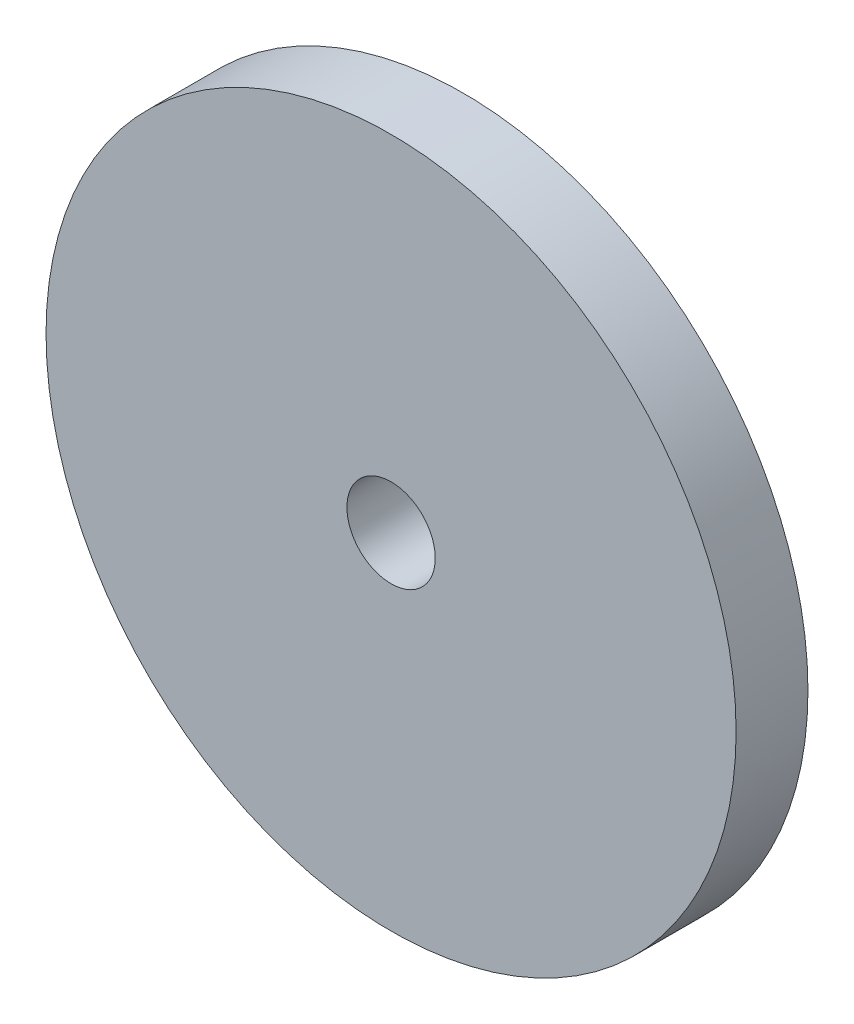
ISO-10303-21;
HEADER;
FILE_DESCRIPTION(('STEP AP214'),'2;1');
FILE_NAME('part.step','',(''),(''),'','','');
FILE_SCHEMA(('AUTOMOTIVE_DESIGN { 1 0 10303 214 1 1 1 1 }'));
ENDSEC;
DATA;
#1=APPLICATION_CONTEXT('core data for automotive mechanical design processes');
#2=APPLICATION_PROTOCOL_DEFINITION('international standard','automotive_design',2000,#1);
#3=PRODUCT_CONTEXT('',#1,'mechanical');
#4=PRODUCT('Part','Part','',(#3));
#5=PRODUCT_RELATED_PRODUCT_CATEGORY('part','',(#4));
#6=PRODUCT_DEFINITION_FORMATION('','',#4);
#7=PRODUCT_DEFINITION_CONTEXT('part definition',#1,'design');
#8=PRODUCT_DEFINITION('design','',#6,#7);
#9=PRODUCT_DEFINITION_SHAPE('','',#8);
#10=(LENGTH_UNIT() NAMED_UNIT(*) SI_UNIT(.MILLI.,.METRE.));
#11=(NAMED_UNIT(*) PLANE_ANGLE_UNIT() SI_UNIT($,.RADIAN.));
#12=(NAMED_UNIT(*) SI_UNIT($,.STERADIAN.) SOLID_ANGLE_UNIT());
#13=UNCERTAINTY_MEASURE_WITH_UNIT(LENGTH_MEASURE(1.E-05),#10,'distance_accuracy_value','');
#14=(GEOMETRIC_REPRESENTATION_CONTEXT(3) GLOBAL_UNCERTAINTY_ASSIGNED_CONTEXT((#13)) GLOBAL_UNIT_ASSIGNED_CONTEXT((#10,
#11,#12)) REPRESENTATION_CONTEXT('',''));
#15=CARTESIAN_POINT('',(0.,0.,0.));
#16=DIRECTION('',(0.,0.,1.));
#17=DIRECTION('',(1.,0.,0.));
#18=AXIS2_PLACEMENT_3D('',#15,#16,#17);
#19=CARTESIAN_POINT('',(0.,0.,5.2059));
#20=DIRECTION('',(0.,0.,1.));
#21=DIRECTION('',(1.,0.,0.));
#22=AXIS2_PLACEMENT_3D('',#19,#20,#21);
#23=PLANE('',#22);
#24=CARTESIAN_POINT('',(0.,0.,5.2059));
#25=DIRECTION('',(0.,0.,1.));
#26=DIRECTION('',(1.,0.,0.));
#27=AXIS2_PLACEMENT_3D('',#24,#25,#26);
#28=CIRCLE('',#27,25.);
#29=CARTESIAN_POINT('',(25.,0.,5.2059));
#30=VERTEX_POINT('',#29);
#31=EDGE_CURVE('E10',#30,#30,#28,.T.);
#32=ORIENTED_EDGE('',*,*,#31,.T.);
#33=EDGE_LOOP('',(#32));
#34=FACE_BOUND('',#33,.T.);
#35=CARTESIAN_POINT('',(0.,0.,5.2059));
#36=DIRECTION('',(0.,0.,1.));
#37=DIRECTION('',(1.,0.,0.));
#38=AXIS2_PLACEMENT_3D('',#35,#36,#37);
#39=CIRCLE('',#38,3.2);
#40=CARTESIAN_POINT('',(3.2,0.,5.2059));
#41=VERTEX_POINT('',#40);
#42=EDGE_CURVE('E50',#41,#41,#39,.T.);
#43=ORIENTED_EDGE('',*,*,#42,.F.);
#44=EDGE_LOOP('',(#43));
#45=FACE_BOUND('',#44,.T.);
#46=ADVANCED_FACE('F39',(#34,#45),#23,.T.);
#47=CARTESIAN_POINT('',(0.,0.,0.));
#48=DIRECTION('',(0.,0.,1.));
#49=DIRECTION('',(1.,0.,0.));
#50=AXIS2_PLACEMENT_3D('',#47,#48,#49);
#51=PLANE('',#50);
#52=CARTESIAN_POINT('',(0.,0.,0.));
#53=DIRECTION('',(0.,0.,1.));
#54=DIRECTION('',(1.,0.,0.));
#55=AXIS2_PLACEMENT_3D('',#52,#53,#54);
#56=CIRCLE('',#55,25.);
#57=CARTESIAN_POINT('',(25.,0.,0.));
#58=VERTEX_POINT('',#57);
#59=EDGE_CURVE('E43',#58,#58,#56,.T.);
#60=ORIENTED_EDGE('',*,*,#59,.F.);
#61=EDGE_LOOP('',(#60));
#62=FACE_BOUND('',#61,.T.);
#63=CARTESIAN_POINT('',(0.,0.,0.));
#64=DIRECTION('',(0.,0.,1.));
#65=DIRECTION('',(1.,0.,0.));
#66=AXIS2_PLACEMENT_3D('',#63,#64,#65);
#67=CIRCLE('',#66,3.2);
#68=CARTESIAN_POINT('',(3.2,0.,0.));
#69=VERTEX_POINT('',#68);
#70=EDGE_CURVE('E52',#69,#69,#67,.T.);
#71=ORIENTED_EDGE('',*,*,#70,.T.);
#72=EDGE_LOOP('',(#71));
#73=FACE_BOUND('',#72,.T.);
#74=ADVANCED_FACE('F62',(#62,#73),#51,.F.);
#75=CARTESIAN_POINT('',(0.,0.,5.2059));
#76=DIRECTION('',(0.,0.,-1.));
#77=DIRECTION('',(-1.,0.,0.));
#78=AXIS2_PLACEMENT_3D('',#75,#76,#77);
#79=CYLINDRICAL_SURFACE('',#78,25.);
#80=ORIENTED_EDGE('',*,*,#31,.F.);
#81=EDGE_LOOP('',(#80));
#82=FACE_BOUND('',#81,.T.);
#83=ORIENTED_EDGE('',*,*,#59,.T.);
#84=EDGE_LOOP('',(#83));
#85=FACE_BOUND('',#84,.T.);
#86=ADVANCED_FACE('F41',(#82,#85),#79,.T.);
#87=CARTESIAN_POINT('',(0.,0.,5.2059));
#88=DIRECTION('',(0.,0.,-1.));
#89=DIRECTION('',(-1.,0.,0.));
#90=AXIS2_PLACEMENT_3D('',#87,#88,#89);
#91=CYLINDRICAL_SURFACE('',#90,3.2);
#92=ORIENTED_EDGE('',*,*,#42,.T.);
#93=EDGE_LOOP('',(#92));
#94=FACE_BOUND('',#93,.T.);
#95=ORIENTED_EDGE('',*,*,#70,.F.);
#96=EDGE_LOOP('',(#95));
#97=FACE_BOUND('',#96,.T.);
#98=ADVANCED_FACE('F58',(#94,#97),#91,.F.);
#99=CLOSED_SHELL('',(#46,#74,#86,#98));
#100=MANIFOLD_SOLID_BREP('B2',#99);
#101=ADVANCED_BREP_SHAPE_REPRESENTATION('',(#18,#100),#14);
#102=SHAPE_DEFINITION_REPRESENTATION(#9,#101);
ENDSEC;
END-ISO-10303-21;
